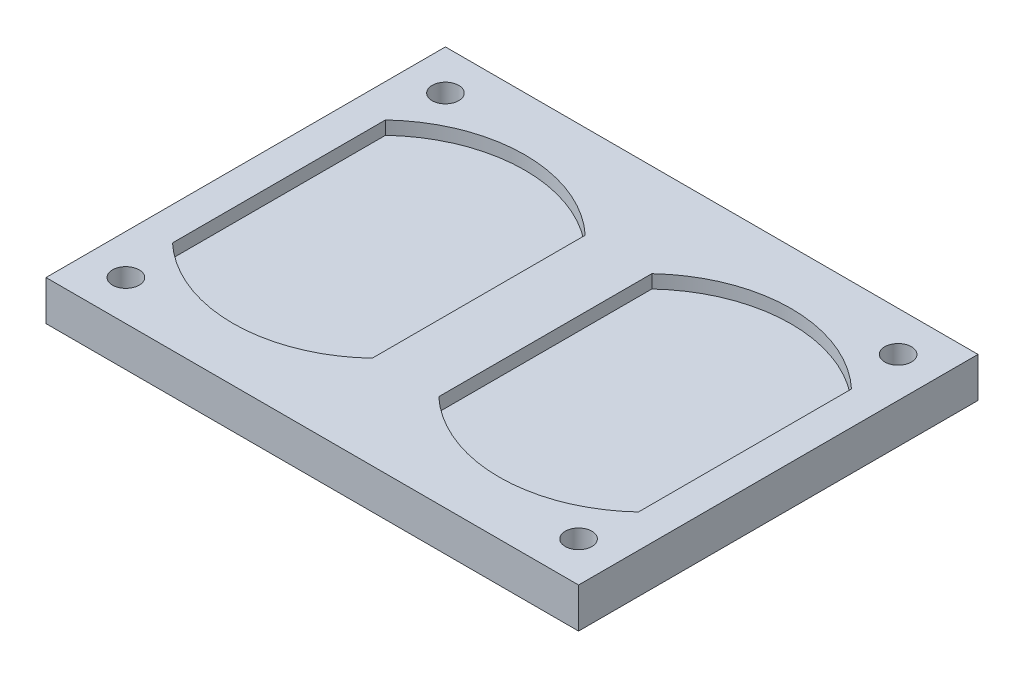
from build123d import *

# Parameters (mm, degrees)
SKETCH1_W                  = 200
SKETCH1_H                  = 150
BOSS_EXTRUDE1_DEPTH        = 15
CUT_EXTRUDE1_DEPTH         = 5
F_10_0_10_DIAMETER_HOLE1_D = 10


with BuildPart() as part:
    # Sketch1 → Boss-Extrude1 (new body)
    with BuildSketch(Plane(origin=(0, 0, 0), x_dir=(1, 0, 0), z_dir=(0, 1, 0))):
        Rectangle(SKETCH1_W, SKETCH1_H)
    extrude(amount=BOSS_EXTRUDE1_DEPTH)

    # Sketch2 → Cut-Extrude1 (cut)
    with BuildSketch(Plane(origin=(0, 15, 0), x_dir=(1, 0, 0), z_dir=(0, 1, 0))):
        with BuildLine():
            Line((12.5, -40), (12.5, 40))
            ThreePointArc((12.5, 40), (50, 54.829280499), (87.5, 40))
            Line((87.5, 40), (87.5, -40))
            ThreePointArc((87.5, -40), (50, -54.829280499), (12.5, -40))
        make_face()
        with BuildLine():
            Line((-87.5, -40), (-87.5, 40))
            ThreePointArc((-87.5, 40), (-50, 54.829280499), (-12.5, 40))
            Line((-12.5, 40), (-12.5, -40))
            ThreePointArc((-12.5, -40), (-50, -54.829280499), (-87.5, -40))
        make_face()
    extrude(amount=-CUT_EXTRUDE1_DEPTH, mode=Mode.SUBTRACT)

    # 10.0 _10_ Diameter Hole1 (through all)
    with Locations(Plane(origin=(0, 15, 0), x_dir=(1, 0, 0), z_dir=(0, 1, 0))):
        with Locations((-85, 60), (85, 60), (85, -60), (-85, -60)):
            Hole(F_10_0_10_DIAMETER_HOLE1_D / 2)


solid = part.part
